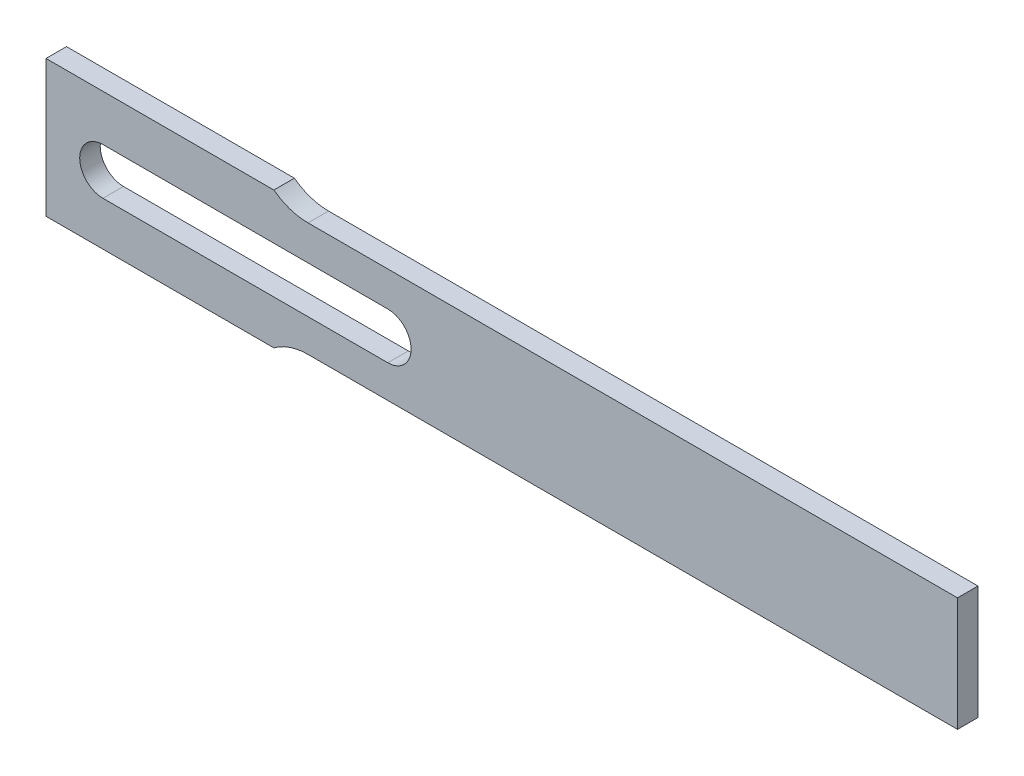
from build123d import *

# Parameters (mm, degrees)
EXTRUDE1_DEPTH = 1.8
EXTRUDE2_DEPTH = 81.244875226


with BuildPart() as part:
    # Sketch1 → Extrude1 (new body)
    with BuildSketch(Plane.XY):
        with BuildLine():
            Line((80, 5), (23, 5))
            ThreePointArc((23, 5), (21.41886117, 5.25658351), (20, 6))
            Line((20, 6), (0, 6))
            Line((0, 6), (0, -6))
            Line((0, -6), (20, -6))
            ThreePointArc((20, -6), (21.41886117, -5.25658351), (23, -5))
            Line((23, -5), (80, -5))
            Line((80, -5), (80, 5))
        make_face()
    extrude(amount=EXTRUDE1_DEPTH)

    # Sketch2 → Extrude2 (cut, through all)
    with BuildSketch(Plane.XY):
        with BuildLine():
            Line((5, -2.130815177), (30, -2.130815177))
            ThreePointArc((30, -2.130815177), (32.042031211, -0.088783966), (30, 1.953247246))
            Line((30, 1.953247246), (5, 1.953247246))
            ThreePointArc((5, 1.953247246), (2.957968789, -0.088783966), (5, -2.130815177))
        make_face()
    extrude(amount=EXTRUDE2_DEPTH, mode=Mode.SUBTRACT)


solid = part.part
